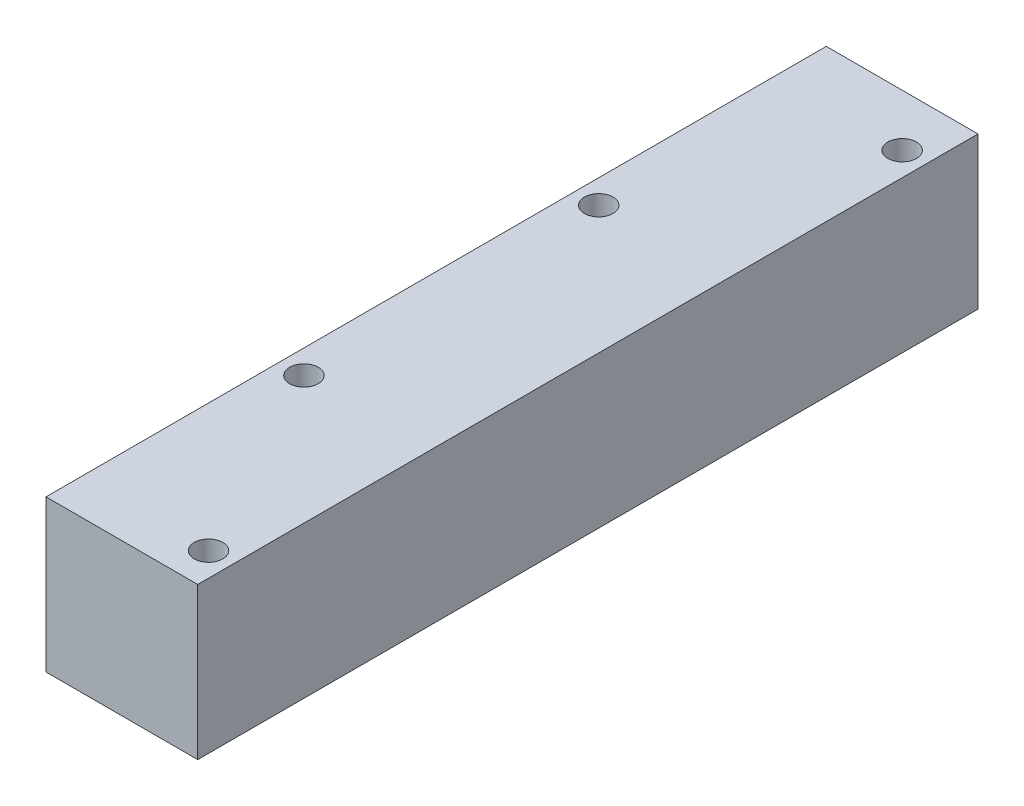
ISO-10303-21;
HEADER;
FILE_DESCRIPTION(('STEP AP214'),'2;1');
FILE_NAME('part.step','',(''),(''),'','','');
FILE_SCHEMA(('AUTOMOTIVE_DESIGN { 1 0 10303 214 1 1 1 1 }'));
ENDSEC;
DATA;
#1=APPLICATION_CONTEXT('core data for automotive mechanical design processes');
#2=APPLICATION_PROTOCOL_DEFINITION('international standard','automotive_design',2000,#1);
#3=PRODUCT_CONTEXT('',#1,'mechanical');
#4=PRODUCT('Part','Part','',(#3));
#5=PRODUCT_RELATED_PRODUCT_CATEGORY('part','',(#4));
#6=PRODUCT_DEFINITION_FORMATION('','',#4);
#7=PRODUCT_DEFINITION_CONTEXT('part definition',#1,'design');
#8=PRODUCT_DEFINITION('design','',#6,#7);
#9=PRODUCT_DEFINITION_SHAPE('','',#8);
#10=(LENGTH_UNIT() NAMED_UNIT(*) SI_UNIT(.MILLI.,.METRE.));
#11=(NAMED_UNIT(*) PLANE_ANGLE_UNIT() SI_UNIT($,.RADIAN.));
#12=(NAMED_UNIT(*) SI_UNIT($,.STERADIAN.) SOLID_ANGLE_UNIT());
#13=UNCERTAINTY_MEASURE_WITH_UNIT(LENGTH_MEASURE(1.E-05),#10,'distance_accuracy_value','');
#14=(GEOMETRIC_REPRESENTATION_CONTEXT(3) GLOBAL_UNCERTAINTY_ASSIGNED_CONTEXT((#13)) GLOBAL_UNIT_ASSIGNED_CONTEXT((#10,
#11,#12)) REPRESENTATION_CONTEXT('',''));
#15=CARTESIAN_POINT('',(0.,0.,0.));
#16=DIRECTION('',(0.,0.,1.));
#17=DIRECTION('',(1.,0.,0.));
#18=AXIS2_PLACEMENT_3D('',#15,#16,#17);
#19=CARTESIAN_POINT('',(0.,0.,0.));
#20=DIRECTION('',(0.,0.,-1.));
#21=DIRECTION('',(0.,-1.,0.));
#22=AXIS2_PLACEMENT_3D('',#19,#20,#21);
#23=PLANE('',#22);
#24=DIRECTION('',(0.,1.,0.));
#25=VECTOR('',#24,1.);
#26=CARTESIAN_POINT('',(8.75,-8.75,0.));
#27=LINE('',#26,#25);
#28=CARTESIAN_POINT('',(8.75,-8.75,0.));
#29=VERTEX_POINT('',#28);
#30=CARTESIAN_POINT('',(8.75,8.75,0.));
#31=VERTEX_POINT('',#30);
#32=EDGE_CURVE('E82',#29,#31,#27,.T.);
#33=ORIENTED_EDGE('',*,*,#32,.F.);
#34=DIRECTION('',(1.,0.,0.));
#35=VECTOR('',#34,1.);
#36=CARTESIAN_POINT('',(-8.75,-8.75,0.));
#37=LINE('',#36,#35);
#38=CARTESIAN_POINT('',(-8.75,-8.75,0.));
#39=VERTEX_POINT('',#38);
#40=EDGE_CURVE('E25',#39,#29,#37,.T.);
#41=ORIENTED_EDGE('',*,*,#40,.F.);
#42=DIRECTION('',(0.,-1.,0.));
#43=VECTOR('',#42,1.);
#44=CARTESIAN_POINT('',(-8.75,-8.75,0.));
#45=LINE('',#44,#43);
#46=CARTESIAN_POINT('',(-8.75,8.75,0.));
#47=VERTEX_POINT('',#46);
#48=EDGE_CURVE('E119',#47,#39,#45,.T.);
#49=ORIENTED_EDGE('',*,*,#48,.F.);
#50=DIRECTION('',(-1.,0.,0.));
#51=VECTOR('',#50,1.);
#52=CARTESIAN_POINT('',(-8.75,8.75,0.));
#53=LINE('',#52,#51);
#54=EDGE_CURVE('E86',#31,#47,#53,.T.);
#55=ORIENTED_EDGE('',*,*,#54,.F.);
#56=EDGE_LOOP('',(#33,#41,#49,#55));
#57=FACE_BOUND('',#56,.T.);
#58=ADVANCED_FACE('F17',(#57),#23,.T.);
#59=CARTESIAN_POINT('',(0.,0.,90.));
#60=DIRECTION('',(0.,0.,-1.));
#61=DIRECTION('',(0.,-1.,0.));
#62=AXIS2_PLACEMENT_3D('',#59,#60,#61);
#63=PLANE('',#62);
#64=DIRECTION('',(0.,1.,0.));
#65=VECTOR('',#64,1.);
#66=CARTESIAN_POINT('',(8.75,-8.75,90.));
#67=LINE('',#66,#65);
#68=CARTESIAN_POINT('',(8.75,-8.75,90.));
#69=VERTEX_POINT('',#68);
#70=CARTESIAN_POINT('',(8.75,8.75,90.));
#71=VERTEX_POINT('',#70);
#72=EDGE_CURVE('E84',#69,#71,#67,.T.);
#73=ORIENTED_EDGE('',*,*,#72,.T.);
#74=DIRECTION('',(-1.,0.,0.));
#75=VECTOR('',#74,1.);
#76=CARTESIAN_POINT('',(-8.75,8.75,90.));
#77=LINE('',#76,#75);
#78=CARTESIAN_POINT('',(-8.75,8.75,90.));
#79=VERTEX_POINT('',#78);
#80=EDGE_CURVE('E115',#71,#79,#77,.T.);
#81=ORIENTED_EDGE('',*,*,#80,.T.);
#82=DIRECTION('',(0.,-1.,0.));
#83=VECTOR('',#82,1.);
#84=CARTESIAN_POINT('',(-8.75,-8.75,90.));
#85=LINE('',#84,#83);
#86=CARTESIAN_POINT('',(-8.75,-8.75,90.));
#87=VERTEX_POINT('',#86);
#88=EDGE_CURVE('E77',#79,#87,#85,.T.);
#89=ORIENTED_EDGE('',*,*,#88,.T.);
#90=DIRECTION('',(1.,0.,0.));
#91=VECTOR('',#90,1.);
#92=CARTESIAN_POINT('',(-8.75,-8.75,90.));
#93=LINE('',#92,#91);
#94=EDGE_CURVE('E11',#87,#69,#93,.T.);
#95=ORIENTED_EDGE('',*,*,#94,.T.);
#96=EDGE_LOOP('',(#73,#81,#89,#95));
#97=FACE_BOUND('',#96,.T.);
#98=ADVANCED_FACE('F128',(#97),#63,.F.);
#99=CARTESIAN_POINT('',(-8.75,-8.75,90.));
#100=DIRECTION('',(0.,1.,0.));
#101=DIRECTION('',(1.,0.,0.));
#102=AXIS2_PLACEMENT_3D('',#99,#100,#101);
#103=PLANE('',#102);
#104=CARTESIAN_POINT('',(-6.,-8.75,29.));
#105=DIRECTION('',(0.,1.,0.));
#106=DIRECTION('',(0.,0.,1.));
#107=AXIS2_PLACEMENT_3D('',#104,#105,#106);
#108=CIRCLE('',#107,1.65);
#109=CARTESIAN_POINT('',(-6.,-8.75,30.65));
#110=VERTEX_POINT('',#109);
#111=EDGE_CURVE('E102',#110,#110,#108,.T.);
#112=ORIENTED_EDGE('',*,*,#111,.T.);
#113=EDGE_LOOP('',(#112));
#114=FACE_BOUND('',#113,.T.);
#115=CARTESIAN_POINT('',(-6.,-8.75,63.));
#116=DIRECTION('',(0.,1.,0.));
#117=DIRECTION('',(0.,0.,1.));
#118=AXIS2_PLACEMENT_3D('',#115,#116,#117);
#119=CIRCLE('',#118,1.65);
#120=CARTESIAN_POINT('',(-6.,-8.75,64.65));
#121=VERTEX_POINT('',#120);
#122=EDGE_CURVE('E164',#121,#121,#119,.T.);
#123=ORIENTED_EDGE('',*,*,#122,.T.);
#124=EDGE_LOOP('',(#123));
#125=FACE_BOUND('',#124,.T.);
#126=CARTESIAN_POINT('',(6.,-8.75,6.));
#127=DIRECTION('',(0.,1.,0.));
#128=DIRECTION('',(0.,0.,1.));
#129=AXIS2_PLACEMENT_3D('',#126,#127,#128);
#130=CIRCLE('',#129,1.65);
#131=CARTESIAN_POINT('',(6.,-8.75,7.65));
#132=VERTEX_POINT('',#131);
#133=EDGE_CURVE('E168',#132,#132,#130,.T.);
#134=ORIENTED_EDGE('',*,*,#133,.T.);
#135=EDGE_LOOP('',(#134));
#136=FACE_BOUND('',#135,.T.);
#137=CARTESIAN_POINT('',(6.,-8.75,86.));
#138=DIRECTION('',(0.,1.,0.));
#139=DIRECTION('',(0.,0.,1.));
#140=AXIS2_PLACEMENT_3D('',#137,#138,#139);
#141=CIRCLE('',#140,1.65);
#142=CARTESIAN_POINT('',(6.,-8.75,87.65));
#143=VERTEX_POINT('',#142);
#144=EDGE_CURVE('E171',#143,#143,#141,.T.);
#145=ORIENTED_EDGE('',*,*,#144,.T.);
#146=EDGE_LOOP('',(#145));
#147=FACE_BOUND('',#146,.T.);
#148=ORIENTED_EDGE('',*,*,#40,.T.);
#149=DIRECTION('',(0.,0.,-1.));
#150=VECTOR('',#149,1.);
#151=CARTESIAN_POINT('',(8.75,-8.75,90.));
#152=LINE('',#151,#150);
#153=EDGE_CURVE('E71',#69,#29,#152,.T.);
#154=ORIENTED_EDGE('',*,*,#153,.F.);
#155=ORIENTED_EDGE('',*,*,#94,.F.);
#156=DIRECTION('',(0.,0.,-1.));
#157=VECTOR('',#156,1.);
#158=CARTESIAN_POINT('',(-8.75,-8.75,90.));
#159=LINE('',#158,#157);
#160=EDGE_CURVE('E74',#87,#39,#159,.T.);
#161=ORIENTED_EDGE('',*,*,#160,.T.);
#162=EDGE_LOOP('',(#148,#154,#155,#161));
#163=FACE_BOUND('',#162,.T.);
#164=ADVANCED_FACE('F70',(#114,#125,#136,#147,#163),#103,.F.);
#165=CARTESIAN_POINT('',(-8.75,-8.75,90.));
#166=DIRECTION('',(1.,0.,0.));
#167=DIRECTION('',(0.,1.,0.));
#168=AXIS2_PLACEMENT_3D('',#165,#166,#167);
#169=PLANE('',#168);
#170=ORIENTED_EDGE('',*,*,#48,.T.);
#171=ORIENTED_EDGE('',*,*,#160,.F.);
#172=ORIENTED_EDGE('',*,*,#88,.F.);
#173=DIRECTION('',(0.,0.,-1.));
#174=VECTOR('',#173,1.);
#175=CARTESIAN_POINT('',(-8.75,8.75,90.));
#176=LINE('',#175,#174);
#177=EDGE_CURVE('E111',#79,#47,#176,.T.);
#178=ORIENTED_EDGE('',*,*,#177,.T.);
#179=EDGE_LOOP('',(#170,#171,#172,#178));
#180=FACE_BOUND('',#179,.T.);
#181=ADVANCED_FACE('F131',(#180),#169,.F.);
#182=CARTESIAN_POINT('',(-8.75,8.75,90.));
#183=DIRECTION('',(0.,-1.,0.));
#184=DIRECTION('',(0.,0.,-1.));
#185=AXIS2_PLACEMENT_3D('',#182,#183,#184);
#186=PLANE('',#185);
#187=CARTESIAN_POINT('',(-6.,8.75,29.));
#188=DIRECTION('',(0.,1.,0.));
#189=DIRECTION('',(0.,0.,1.));
#190=AXIS2_PLACEMENT_3D('',#187,#188,#189);
#191=CIRCLE('',#190,1.65);
#192=CARTESIAN_POINT('',(-6.,8.75,30.65));
#193=VERTEX_POINT('',#192);
#194=EDGE_CURVE('E92',#193,#193,#191,.T.);
#195=ORIENTED_EDGE('',*,*,#194,.F.);
#196=EDGE_LOOP('',(#195));
#197=FACE_BOUND('',#196,.T.);
#198=CARTESIAN_POINT('',(-6.,8.75,63.));
#199=DIRECTION('',(0.,1.,0.));
#200=DIRECTION('',(0.,0.,1.));
#201=AXIS2_PLACEMENT_3D('',#198,#199,#200);
#202=CIRCLE('',#201,1.65);
#203=CARTESIAN_POINT('',(-6.,8.75,64.65));
#204=VERTEX_POINT('',#203);
#205=EDGE_CURVE('E188',#204,#204,#202,.T.);
#206=ORIENTED_EDGE('',*,*,#205,.F.);
#207=EDGE_LOOP('',(#206));
#208=FACE_BOUND('',#207,.T.);
#209=CARTESIAN_POINT('',(6.,8.75,6.));
#210=DIRECTION('',(0.,1.,0.));
#211=DIRECTION('',(0.,0.,1.));
#212=AXIS2_PLACEMENT_3D('',#209,#210,#211);
#213=CIRCLE('',#212,1.65);
#214=CARTESIAN_POINT('',(6.,8.75,7.65));
#215=VERTEX_POINT('',#214);
#216=EDGE_CURVE('E184',#215,#215,#213,.T.);
#217=ORIENTED_EDGE('',*,*,#216,.F.);
#218=EDGE_LOOP('',(#217));
#219=FACE_BOUND('',#218,.T.);
#220=CARTESIAN_POINT('',(6.,8.75,86.));
#221=DIRECTION('',(0.,1.,0.));
#222=DIRECTION('',(0.,0.,1.));
#223=AXIS2_PLACEMENT_3D('',#220,#221,#222);
#224=CIRCLE('',#223,1.65);
#225=CARTESIAN_POINT('',(6.,8.75,87.65));
#226=VERTEX_POINT('',#225);
#227=EDGE_CURVE('E174',#226,#226,#224,.T.);
#228=ORIENTED_EDGE('',*,*,#227,.F.);
#229=EDGE_LOOP('',(#228));
#230=FACE_BOUND('',#229,.T.);
#231=ORIENTED_EDGE('',*,*,#54,.T.);
#232=ORIENTED_EDGE('',*,*,#177,.F.);
#233=ORIENTED_EDGE('',*,*,#80,.F.);
#234=DIRECTION('',(0.,0.,-1.));
#235=VECTOR('',#234,1.);
#236=CARTESIAN_POINT('',(8.75,8.75,90.));
#237=LINE('',#236,#235);
#238=EDGE_CURVE('E91',#71,#31,#237,.T.);
#239=ORIENTED_EDGE('',*,*,#238,.T.);
#240=EDGE_LOOP('',(#231,#232,#233,#239));
#241=FACE_BOUND('',#240,.T.);
#242=ADVANCED_FACE('F133',(#197,#208,#219,#230,#241),#186,.F.);
#243=CARTESIAN_POINT('',(8.75,-8.75,90.));
#244=DIRECTION('',(-1.,0.,0.));
#245=DIRECTION('',(0.,0.,1.));
#246=AXIS2_PLACEMENT_3D('',#243,#244,#245);
#247=PLANE('',#246);
#248=ORIENTED_EDGE('',*,*,#32,.T.);
#249=ORIENTED_EDGE('',*,*,#238,.F.);
#250=ORIENTED_EDGE('',*,*,#72,.F.);
#251=ORIENTED_EDGE('',*,*,#153,.T.);
#252=EDGE_LOOP('',(#248,#249,#250,#251));
#253=FACE_BOUND('',#252,.T.);
#254=ADVANCED_FACE('F80',(#253),#247,.F.);
#255=CARTESIAN_POINT('',(-6.,-31.25,29.));
#256=DIRECTION('',(0.,1.,0.));
#257=DIRECTION('',(0.,0.,1.));
#258=AXIS2_PLACEMENT_3D('',#255,#256,#257);
#259=CYLINDRICAL_SURFACE('',#258,1.65);
#260=ORIENTED_EDGE('',*,*,#194,.T.);
#261=EDGE_LOOP('',(#260));
#262=FACE_BOUND('',#261,.T.);
#263=ORIENTED_EDGE('',*,*,#111,.F.);
#264=EDGE_LOOP('',(#263));
#265=FACE_BOUND('',#264,.T.);
#266=ADVANCED_FACE('F142',(#262,#265),#259,.F.);
#267=CARTESIAN_POINT('',(-6.,-31.25,63.));
#268=DIRECTION('',(0.,1.,0.));
#269=DIRECTION('',(0.,0.,1.));
#270=AXIS2_PLACEMENT_3D('',#267,#268,#269);
#271=CYLINDRICAL_SURFACE('',#270,1.65);
#272=ORIENTED_EDGE('',*,*,#205,.T.);
#273=EDGE_LOOP('',(#272));
#274=FACE_BOUND('',#273,.T.);
#275=ORIENTED_EDGE('',*,*,#122,.F.);
#276=EDGE_LOOP('',(#275));
#277=FACE_BOUND('',#276,.T.);
#278=ADVANCED_FACE('F227',(#274,#277),#271,.F.);
#279=CARTESIAN_POINT('',(6.,-31.25,6.));
#280=DIRECTION('',(0.,1.,0.));
#281=DIRECTION('',(0.,0.,1.));
#282=AXIS2_PLACEMENT_3D('',#279,#280,#281);
#283=CYLINDRICAL_SURFACE('',#282,1.65);
#284=ORIENTED_EDGE('',*,*,#216,.T.);
#285=EDGE_LOOP('',(#284));
#286=FACE_BOUND('',#285,.T.);
#287=ORIENTED_EDGE('',*,*,#133,.F.);
#288=EDGE_LOOP('',(#287));
#289=FACE_BOUND('',#288,.T.);
#290=ADVANCED_FACE('F214',(#286,#289),#283,.F.);
#291=CARTESIAN_POINT('',(6.,-31.25,86.));
#292=DIRECTION('',(0.,1.,0.));
#293=DIRECTION('',(0.,0.,1.));
#294=AXIS2_PLACEMENT_3D('',#291,#292,#293);
#295=CYLINDRICAL_SURFACE('',#294,1.65);
#296=ORIENTED_EDGE('',*,*,#227,.T.);
#297=EDGE_LOOP('',(#296));
#298=FACE_BOUND('',#297,.T.);
#299=ORIENTED_EDGE('',*,*,#144,.F.);
#300=EDGE_LOOP('',(#299));
#301=FACE_BOUND('',#300,.T.);
#302=ADVANCED_FACE('F208',(#298,#301),#295,.F.);
#303=CLOSED_SHELL('',(#58,#98,#164,#181,#242,#254,#266,#278,#290,#302));
#304=MANIFOLD_SOLID_BREP('B1',#303);
#305=ADVANCED_BREP_SHAPE_REPRESENTATION('',(#18,#304),#14);
#306=SHAPE_DEFINITION_REPRESENTATION(#9,#305);
ENDSEC;
END-ISO-10303-21;
